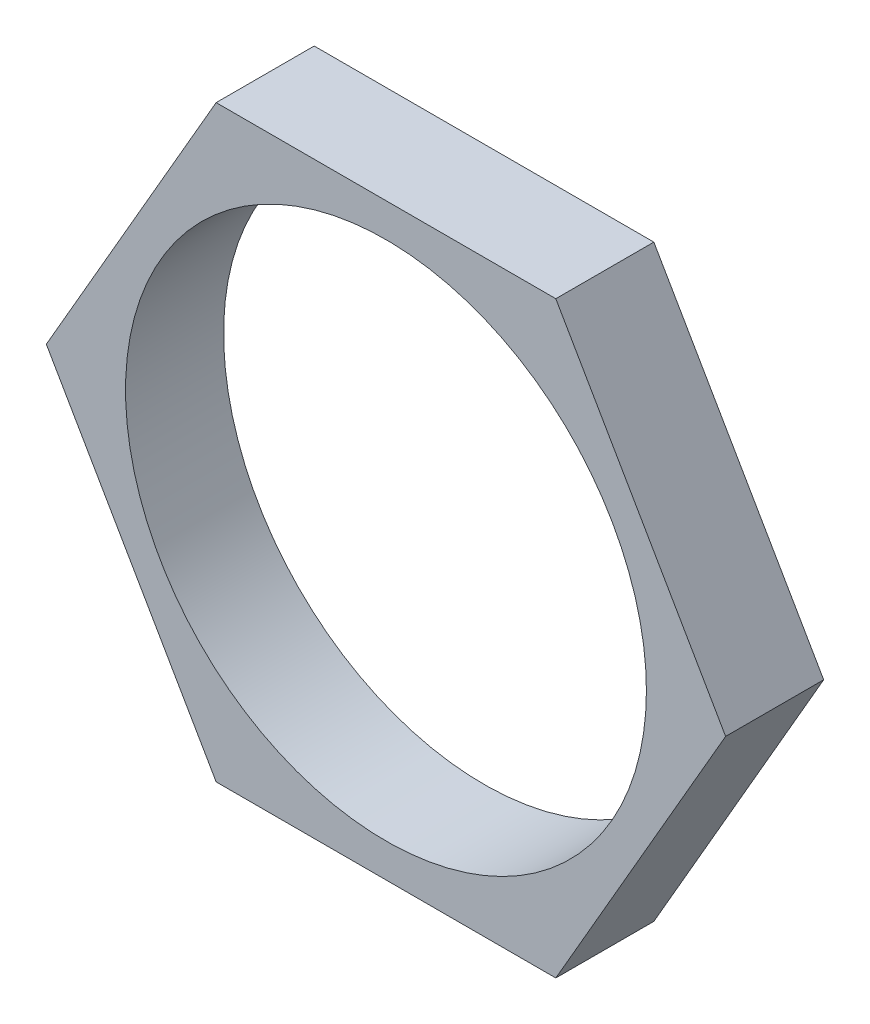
from build123d import *

# Parameters (mm, degrees)
SKETCH1_R           = 21.25
BOSS_EXTRUDE1_DEPTH = 8


with BuildPart() as part:
    # Sketch1 → Boss-Extrude1 (new body)
    with BuildSketch(Plane.XY):
        Polygon((-27.712812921, 0), (-13.856406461, -24), (13.856406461, -24), (27.712812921, 0), (13.856406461, 24), (-13.856406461, 24), align=None)
        Circle(SKETCH1_R, mode=Mode.SUBTRACT)
    extrude(amount=BOSS_EXTRUDE1_DEPTH)


solid = part.part
